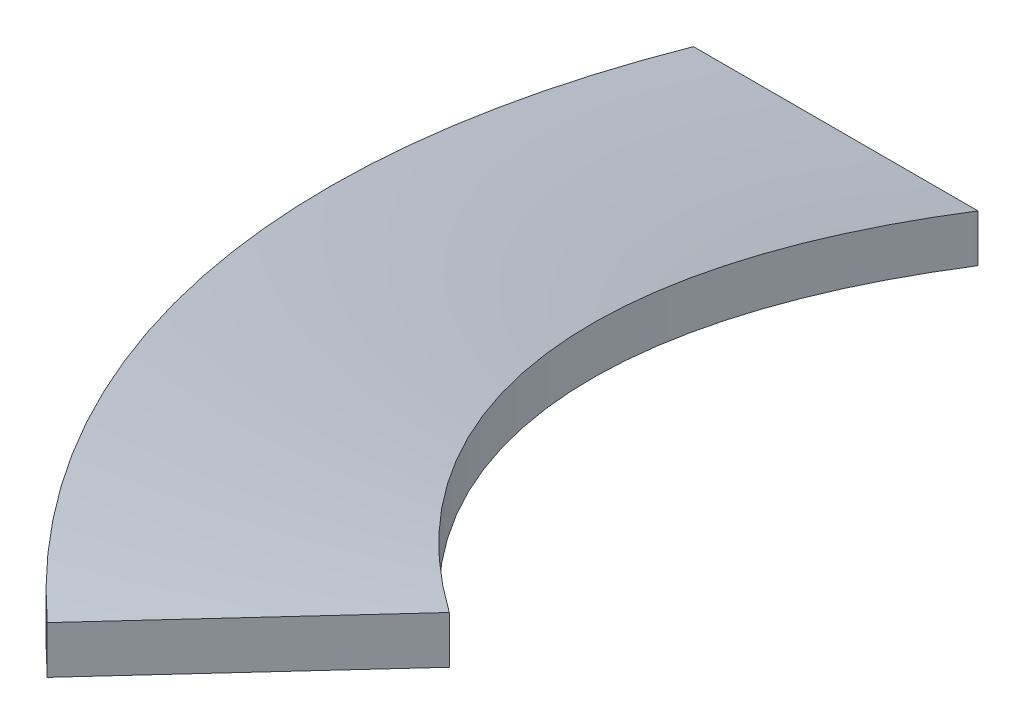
ISO-10303-21;
HEADER;
FILE_DESCRIPTION(('STEP AP214'),'2;1');
FILE_NAME('part.step','',(''),(''),'','','');
FILE_SCHEMA(('AUTOMOTIVE_DESIGN { 1 0 10303 214 1 1 1 1 }'));
ENDSEC;
DATA;
#1=APPLICATION_CONTEXT('core data for automotive mechanical design processes');
#2=APPLICATION_PROTOCOL_DEFINITION('international standard','automotive_design',2000,#1);
#3=PRODUCT_CONTEXT('',#1,'mechanical');
#4=PRODUCT('Part','Part','',(#3));
#5=PRODUCT_RELATED_PRODUCT_CATEGORY('part','',(#4));
#6=PRODUCT_DEFINITION_FORMATION('','',#4);
#7=PRODUCT_DEFINITION_CONTEXT('part definition',#1,'design');
#8=PRODUCT_DEFINITION('design','',#6,#7);
#9=PRODUCT_DEFINITION_SHAPE('','',#8);
#10=(LENGTH_UNIT() NAMED_UNIT(*) SI_UNIT(.MILLI.,.METRE.));
#11=(NAMED_UNIT(*) PLANE_ANGLE_UNIT() SI_UNIT($,.RADIAN.));
#12=(NAMED_UNIT(*) SI_UNIT($,.STERADIAN.) SOLID_ANGLE_UNIT());
#13=UNCERTAINTY_MEASURE_WITH_UNIT(LENGTH_MEASURE(1.E-05),#10,'distance_accuracy_value','');
#14=(GEOMETRIC_REPRESENTATION_CONTEXT(3) GLOBAL_UNCERTAINTY_ASSIGNED_CONTEXT((#13)) GLOBAL_UNIT_ASSIGNED_CONTEXT((#10,
#11,#12)) REPRESENTATION_CONTEXT('',''));
#15=CARTESIAN_POINT('',(0.,0.,0.));
#16=DIRECTION('',(0.,0.,1.));
#17=DIRECTION('',(1.,0.,0.));
#18=AXIS2_PLACEMENT_3D('',#15,#16,#17);
#19=CARTESIAN_POINT('',(-270.,0.,0.));
#20=DIRECTION('',(0.,0.,1.));
#21=DIRECTION('',(1.,0.,0.));
#22=AXIS2_PLACEMENT_3D('',#19,#20,#21);
#23=PLANE('',#22);
#24=DIRECTION('',(0.,1.,0.));
#25=VECTOR('',#24,1.);
#26=CARTESIAN_POINT('',(-270.,-10.,0.));
#27=LINE('',#26,#25);
#28=CARTESIAN_POINT('',(-270.,-10.,0.));
#29=VERTEX_POINT('',#28);
#30=CARTESIAN_POINT('',(-270.,0.,0.));
#31=VERTEX_POINT('',#30);
#32=EDGE_CURVE('E166',#29,#31,#27,.T.);
#33=ORIENTED_EDGE('',*,*,#32,.F.);
#34=DIRECTION('',(1.,0.,0.));
#35=VECTOR('',#34,1.);
#36=CARTESIAN_POINT('',(-330.,-10.,0.));
#37=LINE('',#36,#35);
#38=CARTESIAN_POINT('',(-330.,-10.,0.));
#39=VERTEX_POINT('',#38);
#40=EDGE_CURVE('E159',#39,#29,#37,.T.);
#41=ORIENTED_EDGE('',*,*,#40,.F.);
#42=DIRECTION('',(0.,-1.,0.));
#43=VECTOR('',#42,1.);
#44=CARTESIAN_POINT('',(-330.,0.,0.));
#45=LINE('',#44,#43);
#46=CARTESIAN_POINT('',(-330.,0.,0.));
#47=VERTEX_POINT('',#46);
#48=EDGE_CURVE('E179',#47,#39,#45,.T.);
#49=ORIENTED_EDGE('',*,*,#48,.F.);
#50=DIRECTION('',(-1.,0.,0.));
#51=VECTOR('',#50,1.);
#52=CARTESIAN_POINT('',(-270.,0.,0.));
#53=LINE('',#52,#51);
#54=EDGE_CURVE('E184',#31,#47,#53,.T.);
#55=ORIENTED_EDGE('',*,*,#54,.F.);
#56=EDGE_LOOP('',(#33,#41,#49,#55));
#57=FACE_BOUND('',#56,.T.);
#58=ADVANCED_FACE('F120',(#57),#23,.F.);
#59=CARTESIAN_POINT('',(-222.944768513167,60.,243.301521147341));
#60=DIRECTION('',(0.737277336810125,0.,0.675590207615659));
#61=DIRECTION('',(0.675590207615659,0.,-0.737277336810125));
#62=AXIS2_PLACEMENT_3D('',#59,#60,#61);
#63=PLANE('',#62);
#64=DIRECTION('',(0.,-1.,0.));
#65=VECTOR('',#64,1.);
#66=CARTESIAN_POINT('',(-222.944768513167,70.,243.301521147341));
#67=LINE('',#66,#65);
#68=CARTESIAN_POINT('',(-222.944768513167,70.,243.301521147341));
#69=VERTEX_POINT('',#68);
#70=CARTESIAN_POINT('',(-222.944768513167,60.,243.301521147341));
#71=VERTEX_POINT('',#70);
#72=EDGE_CURVE('E253',#69,#71,#67,.T.);
#73=ORIENTED_EDGE('',*,*,#72,.T.);
#74=DIRECTION('',(0.675590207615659,0.,-0.737277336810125));
#75=VECTOR('',#74,1.);
#76=CARTESIAN_POINT('',(-222.944768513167,60.,243.301521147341));
#77=LINE('',#76,#75);
#78=CARTESIAN_POINT('',(-182.409356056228,60.,199.064880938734));
#79=VERTEX_POINT('',#78);
#80=EDGE_CURVE('E247',#71,#79,#77,.T.);
#81=ORIENTED_EDGE('',*,*,#80,.T.);
#82=DIRECTION('',(0.,1.,0.));
#83=VECTOR('',#82,1.);
#84=CARTESIAN_POINT('',(-182.409356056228,70.,199.064880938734));
#85=LINE('',#84,#83);
#86=CARTESIAN_POINT('',(-182.409356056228,70.,199.064880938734));
#87=VERTEX_POINT('',#86);
#88=EDGE_CURVE('E131',#79,#87,#85,.T.);
#89=ORIENTED_EDGE('',*,*,#88,.T.);
#90=DIRECTION('',(-0.675590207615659,0.,0.737277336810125));
#91=VECTOR('',#90,1.);
#92=CARTESIAN_POINT('',(-222.944768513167,70.,243.301521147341));
#93=LINE('',#92,#91);
#94=EDGE_CURVE('E13',#87,#69,#93,.T.);
#95=ORIENTED_EDGE('',*,*,#94,.T.);
#96=EDGE_LOOP('',(#73,#81,#89,#95));
#97=FACE_BOUND('',#96,.T.);
#98=ADVANCED_FACE('F214',(#97),#63,.T.);
#99=CARTESIAN_POINT('',(-182.409356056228,60.,199.064880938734));
#100=CARTESIAN_POINT('',(-243.993128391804,41.3999576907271,150.067308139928));
#101=CARTESIAN_POINT('',(-276.322196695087,15.8137835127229,76.5939114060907));
#102=CARTESIAN_POINT('',(-270.,-10.,0.));
#103=CARTESIAN_POINT('',(-184.098331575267,60.,200.908074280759));
#104=CARTESIAN_POINT('',(-245.952445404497,41.3999576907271,151.296103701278));
#105=CARTESIAN_POINT('',(-278.551855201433,15.8137835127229,77.2083091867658));
#106=CARTESIAN_POINT('',(-272.5,-10.,0.));
#107=CARTESIAN_POINT('',(-187.476282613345,60.,204.59446096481));
#108=CARTESIAN_POINT('',(-249.871079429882,41.3999576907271,153.753694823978));
#109=CARTESIAN_POINT('',(-283.011172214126,15.8137835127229,78.437104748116));
#110=CARTESIAN_POINT('',(-277.5,-10.,0.));
#111=CARTESIAN_POINT('',(-192.543209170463,60.,210.124040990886));
#112=CARTESIAN_POINT('',(-255.74903046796,41.3999576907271,157.440081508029));
#113=CARTESIAN_POINT('',(-289.700147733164,15.8137835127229,80.2802980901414));
#114=CARTESIAN_POINT('',(-284.999999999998,-9.99999999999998,0.));
#115=CARTESIAN_POINT('',(-197.610135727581,60.,215.653621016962));
#116=CARTESIAN_POINT('',(-261.626981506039,41.3999576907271,161.12646819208));
#117=CARTESIAN_POINT('',(-296.389123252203,15.8137835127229,82.1234914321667));
#118=CARTESIAN_POINT('',(-292.499999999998,-10.,0.));
#119=CARTESIAN_POINT('',(-200.988086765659,60.,219.340007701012));
#120=CARTESIAN_POINT('',(-265.545615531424,41.3999576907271,163.58405931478));
#121=CARTESIAN_POINT('',(-300.848440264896,15.8137835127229,83.3522869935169));
#122=CARTESIAN_POINT('',(-297.499999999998,-10.,0.));
#123=CARTESIAN_POINT('',(-204.366037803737,60.,223.026394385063));
#124=CARTESIAN_POINT('',(-269.46424955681,41.3999576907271,166.041650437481));
#125=CARTESIAN_POINT('',(-305.307757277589,15.8137835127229,84.5810825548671));
#126=CARTESIAN_POINT('',(-302.499999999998,-10.,0.));
#127=CARTESIAN_POINT('',(-207.743988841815,60.,226.712781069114));
#128=CARTESIAN_POINT('',(-273.382883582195,41.3999576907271,168.499241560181));
#129=CARTESIAN_POINT('',(-309.767074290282,15.8137835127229,85.8098781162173));
#130=CARTESIAN_POINT('',(-307.499999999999,-10.,0.));
#131=CARTESIAN_POINT('',(-212.810915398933,60.0000000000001,232.24236109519));
#132=CARTESIAN_POINT('',(-279.260834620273,41.3999576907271,172.185628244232));
#133=CARTESIAN_POINT('',(-316.456049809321,15.8137835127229,87.6530714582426));
#134=CARTESIAN_POINT('',(-314.999999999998,-9.99999999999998,0.));
#135=CARTESIAN_POINT('',(-217.87784195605,59.9999999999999,237.771941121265));
#136=CARTESIAN_POINT('',(-285.138785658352,41.399957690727,175.872014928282));
#137=CARTESIAN_POINT('',(-323.145025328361,15.8137835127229,89.4962648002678));
#138=CARTESIAN_POINT('',(-322.5,-10.,0.));
#139=CARTESIAN_POINT('',(-221.255792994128,60.,241.458327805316));
#140=CARTESIAN_POINT('',(-289.057419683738,41.3999576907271,178.329606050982));
#141=CARTESIAN_POINT('',(-327.604342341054,15.8137835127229,90.7250603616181));
#142=CARTESIAN_POINT('',(-327.5,-10.,0.));
#143=CARTESIAN_POINT('',(-222.944768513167,60.,243.301521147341));
#144=CARTESIAN_POINT('',(-291.016736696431,41.3999576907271,179.558401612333));
#145=CARTESIAN_POINT('',(-329.8340008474,15.8137835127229,91.3394581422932));
#146=CARTESIAN_POINT('',(-330.,-10.,0.));
#147=B_SPLINE_SURFACE_WITH_KNOTS('',3,3,((#99,#100,#101,#102),(#103,#104,#105,#106),(#107,#108,
#109,#110),(#111,#112,#113,#114),(#115,#116,#117,#118),(#119,#120,#121,#122),(#123,#124,#125,
#126),(#127,#128,#129,#130),(#131,#132,#133,#134),(#135,#136,#137,#138),(#139,#140,#141,#142),
(#143,#144,#145,#146)),.UNSPECIFIED.,.F.,.F.,.F.,(4,1,1,1,2,1,1,1,4),(4,4),(0.571428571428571,
0.624999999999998,0.678571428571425,0.732142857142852,0.785714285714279,0.839285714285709,
0.892857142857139,0.94642857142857,1.),(0.,1.),.UNSPECIFIED.);
#148=CARTESIAN_POINT('',(-222.944768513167,60.,243.301521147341));
#149=CARTESIAN_POINT('',(-291.016736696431,41.3999576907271,179.558401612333));
#150=CARTESIAN_POINT('',(-329.8340008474,15.8137835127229,91.3394581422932));
#151=CARTESIAN_POINT('',(-330.,-10.,0.));
#152=B_SPLINE_CURVE_WITH_KNOTS('',3,(#148,#149,#150,#151),.UNSPECIFIED.,.F.,.F.,(4,4),(0.,1.),.UNSPECIFIED.);
#153=EDGE_CURVE('E172',#71,#39,#152,.T.);
#154=CARTESIAN_POINT('',(-182.409356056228,60.,199.064880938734));
#155=CARTESIAN_POINT('',(-243.993128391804,41.3999576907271,150.067308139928));
#156=CARTESIAN_POINT('',(-276.322196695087,15.8137835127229,76.5939114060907));
#157=CARTESIAN_POINT('',(-270.,-10.,0.));
#158=B_SPLINE_CURVE_WITH_KNOTS('',3,(#154,#155,#156,#157),.UNSPECIFIED.,.F.,.F.,(4,4),(0.,1.),.UNSPECIFIED.);
#159=EDGE_CURVE('E164',#79,#29,#158,.T.);
#160=ORIENTED_EDGE('',*,*,#80,.F.);
#161=ORIENTED_EDGE('',*,*,#153,.T.);
#162=ORIENTED_EDGE('',*,*,#40,.T.);
#163=ORIENTED_EDGE('',*,*,#159,.F.);
#164=EDGE_LOOP('',(#160,#161,#162,#163));
#165=FACE_BOUND('',#164,.T.);
#166=ADVANCED_FACE('F176',(#165),#147,.T.);
#167=CARTESIAN_POINT('',(-182.409356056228,70.,199.064880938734));
#168=CARTESIAN_POINT('',(-243.993128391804,51.3999576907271,150.067308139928));
#169=CARTESIAN_POINT('',(-276.322196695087,25.8137835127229,76.5939114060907));
#170=CARTESIAN_POINT('',(-270.,0.,0.));
#171=CARTESIAN_POINT('',(-182.409356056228,69.1666666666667,199.064880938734));
#172=CARTESIAN_POINT('',(-243.993128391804,50.5666243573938,150.067308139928));
#173=CARTESIAN_POINT('',(-276.322196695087,24.9804501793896,76.5939114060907));
#174=CARTESIAN_POINT('',(-270.,-0.833333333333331,0.));
#175=CARTESIAN_POINT('',(-182.409356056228,67.5000000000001,199.064880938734));
#176=CARTESIAN_POINT('',(-243.993128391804,48.8999576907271,150.067308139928));
#177=CARTESIAN_POINT('',(-276.322196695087,23.3137835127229,76.5939114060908));
#178=CARTESIAN_POINT('',(-270.,-2.5,0.));
#179=CARTESIAN_POINT('',(-182.409356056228,65.,199.064880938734));
#180=CARTESIAN_POINT('',(-243.993128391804,46.3999576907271,150.067308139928));
#181=CARTESIAN_POINT('',(-276.322196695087,20.8137835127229,76.5939114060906));
#182=CARTESIAN_POINT('',(-270.,-5.,0.));
#183=CARTESIAN_POINT('',(-182.409356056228,62.5000000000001,199.064880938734));
#184=CARTESIAN_POINT('',(-243.993128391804,43.8999576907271,150.067308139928));
#185=CARTESIAN_POINT('',(-276.322196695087,18.3137835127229,76.5939114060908));
#186=CARTESIAN_POINT('',(-270.,-7.50000000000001,0.));
#187=CARTESIAN_POINT('',(-182.409356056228,60.8333333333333,199.064880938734));
#188=CARTESIAN_POINT('',(-243.993128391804,42.2332910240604,150.067308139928));
#189=CARTESIAN_POINT('',(-276.322196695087,16.6471168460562,76.5939114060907));
#190=CARTESIAN_POINT('',(-270.,-9.16666666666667,0.));
#191=CARTESIAN_POINT('',(-182.409356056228,60.,199.064880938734));
#192=CARTESIAN_POINT('',(-243.993128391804,41.3999576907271,150.067308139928));
#193=CARTESIAN_POINT('',(-276.322196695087,15.8137835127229,76.5939114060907));
#194=CARTESIAN_POINT('',(-270.,-10.,0.));
#195=B_SPLINE_SURFACE_WITH_KNOTS('',3,3,((#167,#168,#169,#170),(#171,#172,#173,#174),(#175,#176,
#177,#178),(#179,#180,#181,#182),(#183,#184,#185,#186),(#187,#188,#189,#190),(#191,#192,#193,
#194)),.UNSPECIFIED.,.F.,.F.,.F.,(4,1,1,1,4),(4,4),(0.5,0.517857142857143,0.535714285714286,
0.553571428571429,0.571428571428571),(0.,1.),.UNSPECIFIED.);
#196=CARTESIAN_POINT('',(-182.409356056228,70.,199.064880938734));
#197=CARTESIAN_POINT('',(-243.993128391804,51.3999576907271,150.067308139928));
#198=CARTESIAN_POINT('',(-276.322196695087,25.8137835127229,76.5939114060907));
#199=CARTESIAN_POINT('',(-270.,0.,0.));
#200=B_SPLINE_CURVE_WITH_KNOTS('',3,(#196,#197,#198,#199),.UNSPECIFIED.,.F.,.F.,(4,4),(0.,1.),.UNSPECIFIED.);
#201=EDGE_CURVE('E140',#87,#31,#200,.T.);
#202=ORIENTED_EDGE('',*,*,#88,.F.);
#203=ORIENTED_EDGE('',*,*,#159,.T.);
#204=ORIENTED_EDGE('',*,*,#32,.T.);
#205=ORIENTED_EDGE('',*,*,#201,.F.);
#206=EDGE_LOOP('',(#202,#203,#204,#205));
#207=FACE_BOUND('',#206,.T.);
#208=ADVANCED_FACE('F165',(#207),#195,.T.);
#209=CARTESIAN_POINT('',(-222.944768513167,70.,243.301521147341));
#210=CARTESIAN_POINT('',(-291.016736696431,51.3999576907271,179.558401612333));
#211=CARTESIAN_POINT('',(-329.8340008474,25.8137835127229,91.3394581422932));
#212=CARTESIAN_POINT('',(-330.,0.,0.));
#213=CARTESIAN_POINT('',(-219.566817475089,70.,239.615134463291));
#214=CARTESIAN_POINT('',(-287.098102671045,51.3999576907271,177.100810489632));
#215=CARTESIAN_POINT('',(-325.374683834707,25.8137835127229,90.110662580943));
#216=CARTESIAN_POINT('',(-325.,0.,0.));
#217=CARTESIAN_POINT('',(-212.810915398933,70.,232.24236109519));
#218=CARTESIAN_POINT('',(-279.260834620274,51.3999576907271,172.185628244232));
#219=CARTESIAN_POINT('',(-316.456049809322,25.8137835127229,87.6530714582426));
#220=CARTESIAN_POINT('',(-315.,0.,0.));
#221=CARTESIAN_POINT('',(-202.677062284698,70.,221.183201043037));
#222=CARTESIAN_POINT('',(-267.504932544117,51.3999576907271,164.81285487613));
#223=CARTESIAN_POINT('',(-303.078098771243,25.8137835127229,83.9666847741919));
#224=CARTESIAN_POINT('',(-300.,0.,0.));
#225=CARTESIAN_POINT('',(-192.543209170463,70.,210.124040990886));
#226=CARTESIAN_POINT('',(-255.749030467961,51.3999576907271,157.440081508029));
#227=CARTESIAN_POINT('',(-289.700147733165,25.8137835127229,80.2802980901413));
#228=CARTESIAN_POINT('',(-285.,0.,0.));
#229=CARTESIAN_POINT('',(-185.787307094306,70.,202.751267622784));
#230=CARTESIAN_POINT('',(-247.91176241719,51.3999576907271,152.524899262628));
#231=CARTESIAN_POINT('',(-280.78151370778,25.8137835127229,77.8227069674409));
#232=CARTESIAN_POINT('',(-275.,0.,0.));
#233=CARTESIAN_POINT('',(-182.409356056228,70.,199.064880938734));
#234=CARTESIAN_POINT('',(-243.993128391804,51.3999576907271,150.067308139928));
#235=CARTESIAN_POINT('',(-276.322196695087,25.8137835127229,76.5939114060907));
#236=CARTESIAN_POINT('',(-270.,0.,0.));
#237=B_SPLINE_SURFACE_WITH_KNOTS('',3,3,((#209,#210,#211,#212),(#213,#214,#215,#216),(#217,#218,
#219,#220),(#221,#222,#223,#224),(#225,#226,#227,#228),(#229,#230,#231,#232),(#233,#234,#235,
#236)),.UNSPECIFIED.,.F.,.F.,.F.,(4,1,1,1,4),(4,4),(0.0714285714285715,0.178571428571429,
0.285714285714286,0.392857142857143,0.5),(0.,1.),.UNSPECIFIED.);
#238=CARTESIAN_POINT('',(-222.944768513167,70.,243.301521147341));
#239=CARTESIAN_POINT('',(-291.016736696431,51.3999576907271,179.558401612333));
#240=CARTESIAN_POINT('',(-329.8340008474,25.8137835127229,91.3394581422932));
#241=CARTESIAN_POINT('',(-330.,0.,0.));
#242=B_SPLINE_CURVE_WITH_KNOTS('',3,(#238,#239,#240,#241),.UNSPECIFIED.,.F.,.F.,(4,4),(0.,1.),.UNSPECIFIED.);
#243=EDGE_CURVE('E178',#69,#47,#242,.T.);
#244=ORIENTED_EDGE('',*,*,#94,.F.);
#245=ORIENTED_EDGE('',*,*,#201,.T.);
#246=ORIENTED_EDGE('',*,*,#54,.T.);
#247=ORIENTED_EDGE('',*,*,#243,.F.);
#248=EDGE_LOOP('',(#244,#245,#246,#247));
#249=FACE_BOUND('',#248,.T.);
#250=ADVANCED_FACE('F268',(#249),#237,.T.);
#251=CARTESIAN_POINT('',(-222.944768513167,60.,243.301521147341));
#252=CARTESIAN_POINT('',(-291.016736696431,41.3999576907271,179.558401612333));
#253=CARTESIAN_POINT('',(-329.8340008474,15.8137835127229,91.3394581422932));
#254=CARTESIAN_POINT('',(-330.,-10.,0.));
#255=CARTESIAN_POINT('',(-222.944768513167,60.8333333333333,243.301521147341));
#256=CARTESIAN_POINT('',(-291.016736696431,42.2332910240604,179.558401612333));
#257=CARTESIAN_POINT('',(-329.8340008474,16.6471168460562,91.3394581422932));
#258=CARTESIAN_POINT('',(-330.,-9.16666666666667,0.));
#259=CARTESIAN_POINT('',(-222.944768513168,62.5,243.301521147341));
#260=CARTESIAN_POINT('',(-291.016736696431,43.8999576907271,179.558401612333));
#261=CARTESIAN_POINT('',(-329.8340008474,18.3137835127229,91.3394581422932));
#262=CARTESIAN_POINT('',(-330.,-7.5,0.));
#263=CARTESIAN_POINT('',(-222.944768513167,65.0000000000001,243.301521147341));
#264=CARTESIAN_POINT('',(-291.01673669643,46.3999576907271,179.558401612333));
#265=CARTESIAN_POINT('',(-329.8340008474,20.8137835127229,91.3394581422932));
#266=CARTESIAN_POINT('',(-330.,-5.00000000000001,0.));
#267=CARTESIAN_POINT('',(-222.944768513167,67.4999999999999,243.301521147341));
#268=CARTESIAN_POINT('',(-291.016736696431,48.8999576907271,179.558401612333));
#269=CARTESIAN_POINT('',(-329.8340008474,23.3137835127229,91.3394581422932));
#270=CARTESIAN_POINT('',(-330.,-2.5,0.));
#271=CARTESIAN_POINT('',(-222.944768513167,69.1666666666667,243.301521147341));
#272=CARTESIAN_POINT('',(-291.016736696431,50.5666243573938,179.558401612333));
#273=CARTESIAN_POINT('',(-329.8340008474,24.9804501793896,91.3394581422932));
#274=CARTESIAN_POINT('',(-330.,-0.833333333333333,0.));
#275=CARTESIAN_POINT('',(-222.944768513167,70.,243.301521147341));
#276=CARTESIAN_POINT('',(-291.016736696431,51.3999576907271,179.558401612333));
#277=CARTESIAN_POINT('',(-329.8340008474,25.8137835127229,91.3394581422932));
#278=CARTESIAN_POINT('',(-330.,0.,0.));
#279=B_SPLINE_SURFACE_WITH_KNOTS('',3,3,((#251,#252,#253,#254),(#255,#256,#257,#258),(#259,#260,
#261,#262),(#263,#264,#265,#266),(#267,#268,#269,#270),(#271,#272,#273,#274),(#275,#276,#277,
#278)),.UNSPECIFIED.,.F.,.F.,.F.,(4,1,1,1,4),(4,4),(0.,0.0178571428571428,0.0357142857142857,
0.0535714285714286,0.0714285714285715),(0.,1.),.UNSPECIFIED.);
#280=ORIENTED_EDGE('',*,*,#72,.F.);
#281=ORIENTED_EDGE('',*,*,#243,.T.);
#282=ORIENTED_EDGE('',*,*,#48,.T.);
#283=ORIENTED_EDGE('',*,*,#153,.F.);
#284=EDGE_LOOP('',(#280,#281,#282,#283));
#285=FACE_BOUND('',#284,.T.);
#286=ADVANCED_FACE('F224',(#285),#279,.T.);
#287=CLOSED_SHELL('',(#58,#98,#166,#208,#250,#286));
#288=MANIFOLD_SOLID_BREP('B2',#287);
#289=ADVANCED_BREP_SHAPE_REPRESENTATION('',(#18,#288),#14);
#290=SHAPE_DEFINITION_REPRESENTATION(#9,#289);
ENDSEC;
END-ISO-10303-21;
